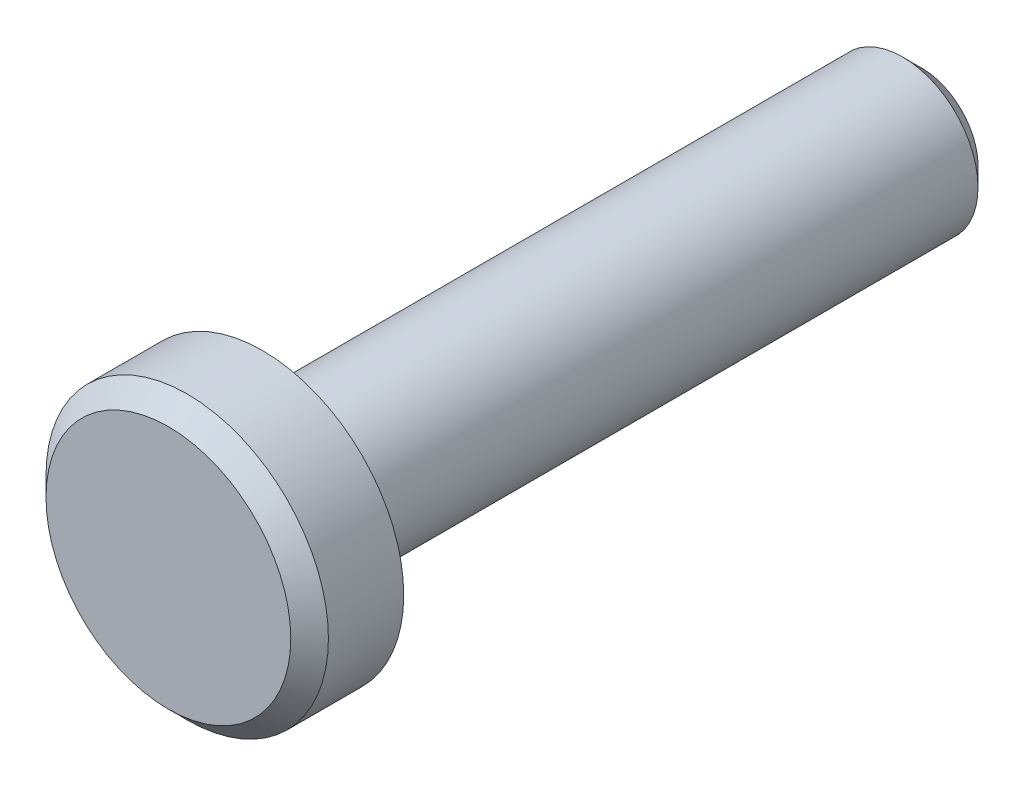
from build123d import *

# Parameters (mm, degrees)
CROQUIS1_R     = 7.5
EXTRUIR1_DEPTH = 5
CROQUIS2_R     = 4
EXTRUIR2_DEPTH = 35
CHAFL_N1_SIZE  = 1


with BuildPart() as part:
    # Croquis1 → Extruir1 (new body)
    with BuildSketch(Plane.XY):
        Circle(CROQUIS1_R)
    extrude(amount=EXTRUIR1_DEPTH)

    # Croquis2 → Extruir2 (add)
    with BuildSketch(Plane(origin=(0, 0, 0), x_dir=(-1, 0, 0), z_dir=(0, 0, -1))):
        with Locations(Location((0, 0, 0), (0, 0, 180))):
            Circle(CROQUIS2_R)
    extrude(amount=EXTRUIR2_DEPTH)

    # Chafl_n1
    chafl_n1_edges = [part.edges().sort_by_distance(p)[0] for p in [
        (-7.5, 0, 5),
        (-4, 0, -35),
    ]]
    chamfer(chafl_n1_edges, length=CHAFL_N1_SIZE)


solid = part.part
